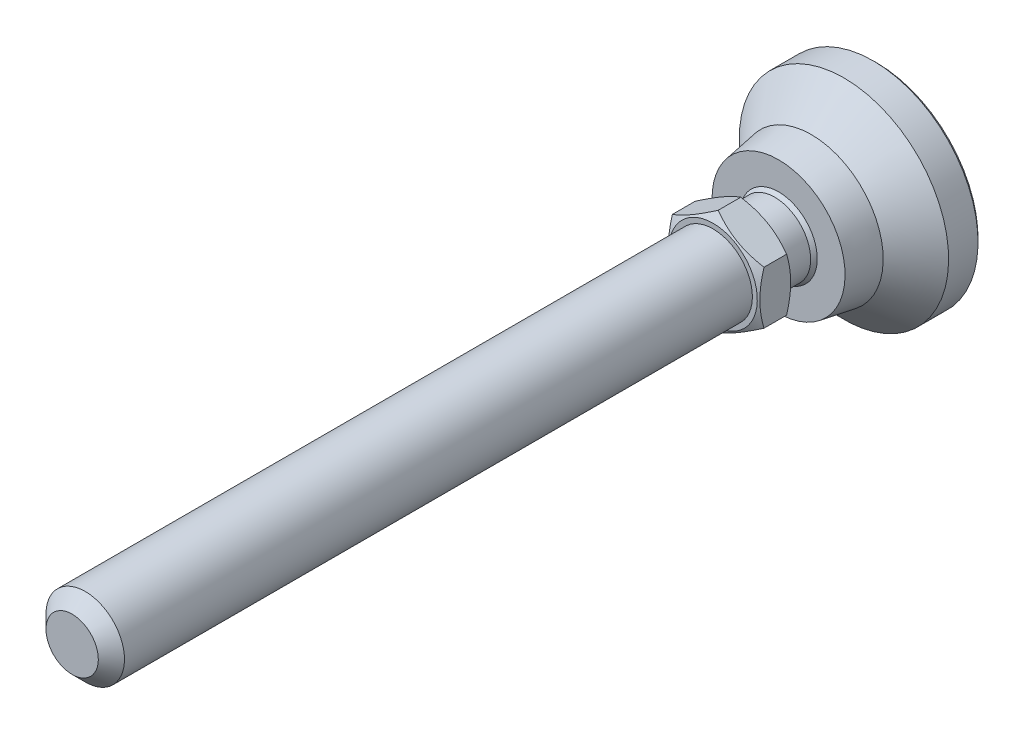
ISO-10303-21;
HEADER;
FILE_DESCRIPTION(('STEP AP214'),'2;1');
FILE_NAME('part.step','',(''),(''),'','','');
FILE_SCHEMA(('AUTOMOTIVE_DESIGN { 1 0 10303 214 1 1 1 1 }'));
ENDSEC;
DATA;
#1=APPLICATION_CONTEXT('core data for automotive mechanical design processes');
#2=APPLICATION_PROTOCOL_DEFINITION('international standard','automotive_design',2000,#1);
#3=PRODUCT_CONTEXT('',#1,'mechanical');
#4=PRODUCT('Part','Part','',(#3));
#5=PRODUCT_RELATED_PRODUCT_CATEGORY('part','',(#4));
#6=PRODUCT_DEFINITION_FORMATION('','',#4);
#7=PRODUCT_DEFINITION_CONTEXT('part definition',#1,'design');
#8=PRODUCT_DEFINITION('design','',#6,#7);
#9=PRODUCT_DEFINITION_SHAPE('','',#8);
#10=(LENGTH_UNIT() NAMED_UNIT(*) SI_UNIT(.MILLI.,.METRE.));
#11=(NAMED_UNIT(*) PLANE_ANGLE_UNIT() SI_UNIT($,.RADIAN.));
#12=(NAMED_UNIT(*) SI_UNIT($,.STERADIAN.) SOLID_ANGLE_UNIT());
#13=UNCERTAINTY_MEASURE_WITH_UNIT(LENGTH_MEASURE(1.E-05),#10,'distance_accuracy_value','');
#14=(GEOMETRIC_REPRESENTATION_CONTEXT(3) GLOBAL_UNCERTAINTY_ASSIGNED_CONTEXT((#13)) GLOBAL_UNIT_ASSIGNED_CONTEXT((#10,
#11,#12)) REPRESENTATION_CONTEXT('',''));
#15=CARTESIAN_POINT('',(0.,0.,0.));
#16=DIRECTION('',(0.,0.,1.));
#17=DIRECTION('',(1.,0.,0.));
#18=AXIS2_PLACEMENT_3D('',#15,#16,#17);
#19=CARTESIAN_POINT('',(0.,-8.08290376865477,19.9999999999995));
#20=DIRECTION('',(0.,0.,-1.));
#21=DIRECTION('',(0.,1.,0.));
#22=AXIS2_PLACEMENT_3D('',#19,#20,#21);
#23=PLANE('',#22);
#24=CARTESIAN_POINT('',(0.,0.,19.9999999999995));
#25=DIRECTION('',(0.,0.,-1.));
#26=DIRECTION('',(0.,1.,0.));
#27=AXIS2_PLACEMENT_3D('',#24,#25,#26);
#28=CIRCLE('',#27,5.50000000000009);
#29=CARTESIAN_POINT('',(0.,5.50000000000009,19.9999999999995));
#30=VERTEX_POINT('',#29);
#31=EDGE_CURVE('E114',#30,#30,#28,.T.);
#32=ORIENTED_EDGE('',*,*,#31,.F.);
#33=EDGE_LOOP('',(#32));
#34=FACE_BOUND('',#33,.T.);
#35=CARTESIAN_POINT('',(0.,0.,19.9999999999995));
#36=DIRECTION('',(0.,0.,-1.));
#37=DIRECTION('',(0.,1.,0.));
#38=AXIS2_PLACEMENT_3D('',#35,#36,#37);
#39=CIRCLE('',#38,6.75);
#40=CARTESIAN_POINT('',(0.,6.75,19.9999999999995));
#41=VERTEX_POINT('',#40);
#42=EDGE_CURVE('E79',#41,#41,#39,.T.);
#43=ORIENTED_EDGE('',*,*,#42,.T.);
#44=EDGE_LOOP('',(#43));
#45=FACE_BOUND('',#44,.T.);
#46=ADVANCED_FACE('F14',(#34,#45),#23,.T.);
#47=CARTESIAN_POINT('',(0.,0.,0.));
#48=DIRECTION('',(0.,0.,-1.));
#49=DIRECTION('',(0.,1.,0.));
#50=AXIS2_PLACEMENT_3D('',#47,#48,#49);
#51=CYLINDRICAL_SURFACE('',#50,5.50000000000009);
#52=ORIENTED_EDGE('',*,*,#31,.T.);
#53=EDGE_LOOP('',(#52));
#54=FACE_BOUND('',#53,.T.);
#55=CARTESIAN_POINT('',(0.,0.,15.5902313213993));
#56=DIRECTION('',(0.,0.,-1.));
#57=DIRECTION('',(0.,1.,0.));
#58=AXIS2_PLACEMENT_3D('',#55,#56,#57);
#59=CIRCLE('',#58,5.50000000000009);
#60=CARTESIAN_POINT('',(-5.50000000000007,0.,15.5902313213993));
#61=VERTEX_POINT('',#60);
#62=EDGE_CURVE('E238',#61,#61,#59,.T.);
#63=ORIENTED_EDGE('',*,*,#62,.F.);
#64=EDGE_LOOP('',(#63));
#65=FACE_BOUND('',#64,.T.);
#66=ADVANCED_FACE('F16',(#54,#65),#51,.T.);
#67=CARTESIAN_POINT('',(0.,0.,11.2601043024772));
#68=DIRECTION('',(0.,0.,-1.));
#69=DIRECTION('',(-1.,0.,0.));
#70=AXIS2_PLACEMENT_3D('',#67,#68,#69);
#71=SPHERICAL_SURFACE('',#70,7.);
#72=CARTESIAN_POINT('',(0.,0.,15.));
#73=DIRECTION('',(0.,0.,-1.));
#74=DIRECTION('',(0.,1.,0.));
#75=AXIS2_PLACEMENT_3D('',#72,#73,#74);
#76=CIRCLE('',#75,5.91719360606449);
#77=CARTESIAN_POINT('',(-5.91719360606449,0.,15.));
#78=VERTEX_POINT('',#77);
#79=EDGE_CURVE('E116',#78,#78,#76,.T.);
#80=CARTESIAN_POINT('',(-5.50000000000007,0.,15.5902313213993));
#81=CARTESIAN_POINT('',(-5.50465946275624,0.,15.5843130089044));
#82=CARTESIAN_POINT('',(-5.50930937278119,0.,15.5783871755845));
#83=CARTESIAN_POINT('',(-5.51859003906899,0.,15.5665205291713));
#84=CARTESIAN_POINT('',(-5.52322079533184,0.,15.5605797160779));
#85=CARTESIAN_POINT('',(-5.53246310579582,0.,15.5486831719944));
#86=CARTESIAN_POINT('',(-5.53707465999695,0.,15.5427274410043));
#87=CARTESIAN_POINT('',(-5.54627851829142,0.,15.5308011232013));
#88=CARTESIAN_POINT('',(-5.55087082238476,0.,15.5248305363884));
#89=CARTESIAN_POINT('',(-5.56003613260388,0.,15.5128745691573));
#90=CARTESIAN_POINT('',(-5.56460913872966,0.,15.5068891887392));
#91=CARTESIAN_POINT('',(-5.57373580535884,0.,15.4949036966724));
#92=CARTESIAN_POINT('',(-5.57828946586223,0.,15.4889035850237));
#93=CARTESIAN_POINT('',(-5.58737739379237,0.,15.4768886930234));
#94=CARTESIAN_POINT('',(-5.59191166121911,0.,15.4708739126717));
#95=CARTESIAN_POINT('',(-5.60096075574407,0.,15.4588297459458));
#96=CARTESIAN_POINT('',(-5.60547558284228,0.,15.4528003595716));
#97=CARTESIAN_POINT('',(-5.6144857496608,0.,15.4407270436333));
#98=CARTESIAN_POINT('',(-5.61898108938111,0.,15.4346831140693));
#99=CARTESIAN_POINT('',(-5.62795223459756,0.,15.4225807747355));
#100=CARTESIAN_POINT('',(-5.6324280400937,0.,15.4165223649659));
#101=CARTESIAN_POINT('',(-5.64136007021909,0.,15.4043911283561));
#102=CARTESIAN_POINT('',(-5.64581629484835,0.,15.398318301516));
#103=CARTESIAN_POINT('',(-5.65470911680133,0.,15.3861582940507));
#104=CARTESIAN_POINT('',(-5.65914571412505,0.,15.3800711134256));
#105=CARTESIAN_POINT('',(-5.66799923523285,0.,15.3678824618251));
#106=CARTESIAN_POINT('',(-5.67241615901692,0.,15.3617809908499));
#107=CARTESIAN_POINT('',(-5.68123028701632,0.,15.3495638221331));
#108=CARTESIAN_POINT('',(-5.68562749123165,0.,15.3434481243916));
#109=CARTESIAN_POINT('',(-5.69440213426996,0.,15.3312025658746));
#110=CARTESIAN_POINT('',(-5.69877957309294,0.,15.3250727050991));
#111=CARTESIAN_POINT('',(-5.70751463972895,0.,15.3127988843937));
#112=CARTESIAN_POINT('',(-5.71187226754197,0.,15.3066549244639));
#113=CARTESIAN_POINT('',(-5.72056766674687,0.,15.2943529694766));
#114=CARTESIAN_POINT('',(-5.72490543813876,0.,15.2881949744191));
#115=CARTESIAN_POINT('',(-5.73356107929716,0.,15.2758650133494));
#116=CARTESIAN_POINT('',(-5.73787894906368,0.,15.2696930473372));
#117=CARTESIAN_POINT('',(-5.74649474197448,0.,15.2573352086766));
#118=CARTESIAN_POINT('',(-5.75079266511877,0.,15.2511493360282));
#119=CARTESIAN_POINT('',(-5.75936851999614,0.,15.2387637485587));
#120=CARTESIAN_POINT('',(-5.76364645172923,0.,15.2325640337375));
#121=CARTESIAN_POINT('',(-5.77218227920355,0.,15.2201508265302));
#122=CARTESIAN_POINT('',(-5.77644017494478,0.,15.2139373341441));
#123=CARTESIAN_POINT('',(-5.78493588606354,0.,15.2014966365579));
#124=CARTESIAN_POINT('',(-5.78917370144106,0.,15.195269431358));
#125=CARTESIAN_POINT('',(-5.79762920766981,0.,15.1828013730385));
#126=CARTESIAN_POINT('',(-5.80184689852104,0.,15.1765605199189));
#127=CARTESIAN_POINT('',(-5.81026211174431,0.,15.1640652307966));
#128=CARTESIAN_POINT('',(-5.81445963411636,0.,15.1578107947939));
#129=CARTESIAN_POINT('',(-5.82283446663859,0.,15.1452884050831));
#130=CARTESIAN_POINT('',(-5.82701177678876,0.,15.1390204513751));
#131=CARTESIAN_POINT('',(-5.83534614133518,0.,15.1264710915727));
#132=CARTESIAN_POINT('',(-5.83950319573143,0.,15.1201896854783));
#133=CARTESIAN_POINT('',(-5.84779700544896,0.,15.107613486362));
#134=CARTESIAN_POINT('',(-5.85193376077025,0.,15.1013186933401));
#135=CARTESIAN_POINT('',(-5.86018692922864,0.,15.0887157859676));
#136=CARTESIAN_POINT('',(-5.86430334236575,0.,15.0824076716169));
#137=CARTESIAN_POINT('',(-5.87251578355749,0.,15.0697781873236));
#138=CARTESIAN_POINT('',(-5.87661181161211,0.,15.063456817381));
#139=CARTESIAN_POINT('',(-5.88478343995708,0.,15.0508008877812));
#140=CARTESIAN_POINT('',(-5.88885904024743,0.,15.044466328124));
#141=CARTESIAN_POINT('',(-5.89698977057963,0.,15.0317840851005));
#142=CARTESIAN_POINT('',(-5.90104490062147,0.,15.0254364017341));
#143=CARTESIAN_POINT('',(-5.909134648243,0.,15.0127279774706));
#144=CARTESIAN_POINT('',(-5.9131692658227,0.,15.0063672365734));
#145=CARTESIAN_POINT('',(-5.91719360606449,0.,15.));
#146=B_SPLINE_CURVE_WITH_KNOTS('',3,(#80,#81,#82,#83,#84,#85,#86,#87,#88,#89,#90,#91,#92,#93,
#94,#95,#96,#97,#98,#99,#100,#101,#102,#103,#104,#105,#106,#107,#108,#109,#110,#111,#112,#113,
#114,#115,#116,#117,#118,#119,#120,#121,#122,#123,#124,#125,#126,#127,#128,#129,#130,#131,#132,
#133,#134,#135,#136,#137,#138,#139,#140,#141,#142,#143,#144,#145),.UNSPECIFIED.,.F.,.F.,(4,2,2,
2,2,2,2,2,2,2,2,2,2,2,2,2,2,2,2,2,2,2,2,2,2,2,2,2,2,2,2,2,4),(0.,0.0225971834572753,
0.0451943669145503,0.0677915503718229,0.0903887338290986,0.112985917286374,0.135583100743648,
0.158180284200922,0.180777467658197,0.203374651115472,0.225971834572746,0.248569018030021,
0.271166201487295,0.293763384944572,0.316360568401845,0.338957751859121,0.361554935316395,
0.384152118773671,0.406749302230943,0.429346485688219,0.451943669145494,0.474540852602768,
0.497138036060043,0.519735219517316,0.542332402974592,0.564929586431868,0.587526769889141,
0.610123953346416,0.632721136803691,0.655318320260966,0.67791550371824,0.700512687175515,
0.72310987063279),.UNSPECIFIED.);
#147=EDGE_CURVE('BSEAM251',#61,#78,#146,.T.);
#148=ORIENTED_EDGE('',*,*,#62,.T.);
#149=ORIENTED_EDGE('',*,*,#79,.F.);
#150=ORIENTED_EDGE('',*,*,#147,.T.);
#151=ORIENTED_EDGE('',*,*,#147,.F.);
#152=EDGE_LOOP('',(#148,#150,#149,#151));
#153=FACE_BOUND('',#152,.T.);
#154=ADVANCED_FACE('F251',(#153),#71,.T.);
#155=CARTESIAN_POINT('',(-15.5,0.,0.));
#156=DIRECTION('',(0.,0.,1.));
#157=DIRECTION('',(0.,-1.,0.));
#158=AXIS2_PLACEMENT_3D('',#155,#156,#157);
#159=PLANE('',#158);
#160=CARTESIAN_POINT('',(0.,0.,0.));
#161=DIRECTION('',(0.,0.,-1.));
#162=DIRECTION('',(0.,1.,0.));
#163=AXIS2_PLACEMENT_3D('',#160,#161,#162);
#164=CIRCLE('',#163,15.5);
#165=CARTESIAN_POINT('',(0.,15.5,0.));
#166=VERTEX_POINT('',#165);
#167=EDGE_CURVE('E88',#166,#166,#164,.T.);
#168=ORIENTED_EDGE('',*,*,#167,.T.);
#169=EDGE_LOOP('',(#168));
#170=FACE_BOUND('',#169,.T.);
#171=ADVANCED_FACE('F253',(#170),#159,.F.);
#172=CARTESIAN_POINT('',(0.,0.,0.500000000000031));
#173=DIRECTION('',(0.,0.,1.));
#174=DIRECTION('',(0.,-1.,0.));
#175=AXIS2_PLACEMENT_3D('',#172,#173,#174);
#176=CONICAL_SURFACE('',#175,16.,0.785398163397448);
#177=ORIENTED_EDGE('',*,*,#167,.F.);
#178=EDGE_LOOP('',(#177));
#179=FACE_BOUND('',#178,.T.);
#180=CARTESIAN_POINT('',(0.,0.,0.500000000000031));
#181=DIRECTION('',(0.,0.,-1.));
#182=DIRECTION('',(0.,1.,0.));
#183=AXIS2_PLACEMENT_3D('',#180,#181,#182);
#184=CIRCLE('',#183,16.);
#185=CARTESIAN_POINT('',(0.,16.,0.500000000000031));
#186=VERTEX_POINT('',#185);
#187=EDGE_CURVE('E91',#186,#186,#184,.T.);
#188=ORIENTED_EDGE('',*,*,#187,.T.);
#189=EDGE_LOOP('',(#188));
#190=FACE_BOUND('',#189,.T.);
#191=ADVANCED_FACE('F260',(#179,#190),#176,.T.);
#192=CARTESIAN_POINT('',(0.,0.,0.));
#193=DIRECTION('',(0.,0.,-1.));
#194=DIRECTION('',(0.,1.,0.));
#195=AXIS2_PLACEMENT_3D('',#192,#193,#194);
#196=CYLINDRICAL_SURFACE('',#195,16.);
#197=ORIENTED_EDGE('',*,*,#187,.F.);
#198=EDGE_LOOP('',(#197));
#199=FACE_BOUND('',#198,.T.);
#200=CARTESIAN_POINT('',(0.,0.,5.00000000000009));
#201=DIRECTION('',(0.,0.,-1.));
#202=DIRECTION('',(0.,1.,0.));
#203=AXIS2_PLACEMENT_3D('',#200,#201,#202);
#204=CIRCLE('',#203,16.);
#205=CARTESIAN_POINT('',(0.,16.,5.00000000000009));
#206=VERTEX_POINT('',#205);
#207=EDGE_CURVE('E108',#206,#206,#204,.T.);
#208=ORIENTED_EDGE('',*,*,#207,.T.);
#209=EDGE_LOOP('',(#208));
#210=FACE_BOUND('',#209,.T.);
#211=ADVANCED_FACE('F361',(#199,#210),#196,.T.);
#212=CARTESIAN_POINT('',(0.,0.,10.));
#213=DIRECTION('',(0.,0.,-1.));
#214=DIRECTION('',(0.,1.,0.));
#215=AXIS2_PLACEMENT_3D('',#212,#213,#214);
#216=CONICAL_SURFACE('',#215,11.,0.785398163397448);
#217=ORIENTED_EDGE('',*,*,#207,.F.);
#218=EDGE_LOOP('',(#217));
#219=FACE_BOUND('',#218,.T.);
#220=CARTESIAN_POINT('',(0.,0.,10.));
#221=DIRECTION('',(0.,0.,-1.));
#222=DIRECTION('',(0.,1.,0.));
#223=AXIS2_PLACEMENT_3D('',#220,#221,#222);
#224=CIRCLE('',#223,11.);
#225=CARTESIAN_POINT('',(0.,11.,10.));
#226=VERTEX_POINT('',#225);
#227=EDGE_CURVE('E111',#226,#226,#224,.T.);
#228=ORIENTED_EDGE('',*,*,#227,.T.);
#229=EDGE_LOOP('',(#228));
#230=FACE_BOUND('',#229,.T.);
#231=ADVANCED_FACE('F351',(#219,#230),#216,.T.);
#232=CARTESIAN_POINT('',(0.,0.,16.));
#233=DIRECTION('',(0.,0.,-1.));
#234=DIRECTION('',(0.,1.,0.));
#235=AXIS2_PLACEMENT_3D('',#232,#233,#234);
#236=CONICAL_SURFACE('',#235,10.,0.165148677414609);
#237=ORIENTED_EDGE('',*,*,#227,.F.);
#238=EDGE_LOOP('',(#237));
#239=FACE_BOUND('',#238,.T.);
#240=CARTESIAN_POINT('',(0.,0.,15.));
#241=DIRECTION('',(0.,0.,-1.));
#242=DIRECTION('',(0.,1.,0.));
#243=AXIS2_PLACEMENT_3D('',#240,#241,#242);
#244=CIRCLE('',#243,10.1666666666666);
#245=CARTESIAN_POINT('',(0.,10.1666666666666,15.));
#246=VERTEX_POINT('',#245);
#247=EDGE_CURVE('E96',#246,#246,#244,.T.);
#248=ORIENTED_EDGE('',*,*,#247,.T.);
#249=EDGE_LOOP('',(#248));
#250=FACE_BOUND('',#249,.T.);
#251=ADVANCED_FACE('F245',(#239,#250),#236,.T.);
#252=CARTESIAN_POINT('',(-6.60079601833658,0.,15.));
#253=DIRECTION('',(0.,0.,1.));
#254=DIRECTION('',(0.,-1.,0.));
#255=AXIS2_PLACEMENT_3D('',#252,#253,#254);
#256=PLANE('',#255);
#257=ORIENTED_EDGE('',*,*,#247,.F.);
#258=EDGE_LOOP('',(#257));
#259=FACE_BOUND('',#258,.T.);
#260=ORIENTED_EDGE('',*,*,#79,.T.);
#261=EDGE_LOOP('',(#260));
#262=FACE_BOUND('',#261,.T.);
#263=ADVANCED_FACE('F164',(#259,#262),#256,.T.);
#264=CARTESIAN_POINT('',(0.,0.,19.9999999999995));
#265=DIRECTION('',(0.,0.,1.));
#266=DIRECTION('',(0.,-1.,0.));
#267=AXIS2_PLACEMENT_3D('',#264,#265,#266);
#268=CONICAL_SURFACE('',#267,6.75,1.0471975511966);
#269=CARTESIAN_POINT('',(-7.0002,-4.04133641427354,20.7696190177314));
#270=CARTESIAN_POINT('',(-6.84633209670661,-4.13017208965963,20.7183374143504));
#271=CARTESIAN_POINT('',(-6.69189049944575,-4.21933898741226,20.6693831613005));
#272=CARTESIAN_POINT('',(-6.38175307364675,-4.39839691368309,20.576770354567));
#273=CARTESIAN_POINT('',(-6.22605673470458,-4.48828823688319,20.5331140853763));
#274=CARTESIAN_POINT('',(-5.75647483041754,-4.7594014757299,20.4109491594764));
#275=CARTESIAN_POINT('',(-5.4407356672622,-4.94169356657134,20.3414631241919));
#276=CARTESIAN_POINT('',(-4.96823775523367,-5.21449036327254,20.259982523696));
#277=CARTESIAN_POINT('',(-4.81289077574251,-5.30417998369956,20.2367710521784));
#278=CARTESIAN_POINT('',(-4.50149488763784,-5.48396448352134,20.1978487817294));
#279=CARTESIAN_POINT('',(-4.34544604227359,-5.57405932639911,20.1821373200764));
#280=CARTESIAN_POINT('',(-4.03307732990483,-5.75440548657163,20.15861548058));
#281=CARTESIAN_POINT('',(-3.87675797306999,-5.84465650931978,20.1507961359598));
#282=CARTESIAN_POINT('',(-3.56398349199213,-6.02523694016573,20.1432178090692));
#283=CARTESIAN_POINT('',(-3.40752837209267,-6.11556634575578,20.1434585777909));
#284=CARTESIAN_POINT('',(-2.97889312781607,-6.36303901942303,20.1551972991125));
#285=CARTESIAN_POINT('',(-2.7068533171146,-6.52010127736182,20.1749033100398));
#286=CARTESIAN_POINT('',(-2.1645805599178,-6.83318259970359,20.2373910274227));
#287=CARTESIAN_POINT('',(-1.89434952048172,-6.9892005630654,20.2801940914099));
#288=CARTESIAN_POINT('',(-1.35098545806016,-7.30291195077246,20.3871892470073));
#289=CARTESIAN_POINT('',(-1.07792099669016,-7.46056579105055,20.4518346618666));
#290=CARTESIAN_POINT('',(-0.535864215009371,-7.77352241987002,20.5985536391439));
#291=CARTESIAN_POINT('',(-0.266864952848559,-7.92882921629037,20.6805927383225));
#292=CARTESIAN_POINT('',(0.00020000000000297,-8.0830192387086,20.7696190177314));
#293=B_SPLINE_CURVE_WITH_KNOTS('',3,(#269,#270,#271,#272,#273,#274,#275,#276,#277,#278,#279,
#280,#281,#282,#283,#284,#285,#286,#287,#288,#289,#290,#291,#292),.UNSPECIFIED.,.F.,.F.,(4,2,2,
2,2,2,2,2,2,2,2,4),(0.,0.554727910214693,1.10969417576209,2.2219327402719,2.76443041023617,
3.30688013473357,3.8487128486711,4.39052882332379,5.33376515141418,6.27787517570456,
7.2429241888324,8.20607866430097),.UNSPECIFIED.);
#294=CARTESIAN_POINT('',(-7.,-4.04145188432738,20.7695523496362));
#295=VERTEX_POINT('',#294);
#296=CARTESIAN_POINT('',(0.,-8.08290376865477,20.7695523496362));
#297=VERTEX_POINT('',#296);
#298=EDGE_CURVE('E72',#295,#297,#293,.T.);
#299=ORIENTED_EDGE('',*,*,#298,.F.);
#300=CARTESIAN_POINT('',(-7.,10.8288805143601,23.547450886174));
#301=CARTESIAN_POINT('',(-7.,10.5233685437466,23.3993587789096));
#302=CARTESIAN_POINT('',(-7.,10.217152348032,23.2526944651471));
#303=CARTESIAN_POINT('',(-7.,9.60293688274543,22.9630249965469));
#304=CARTESIAN_POINT('',(-7.,9.29493733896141,22.8200204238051));
#305=CARTESIAN_POINT('',(-7.,8.67518069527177,22.5377487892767));
#306=CARTESIAN_POINT('',(-7.,8.36341224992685,22.3985065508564));
#307=CARTESIAN_POINT('',(-7.,7.737386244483,22.1257564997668));
#308=CARTESIAN_POINT('',(-7.,7.42312880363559,21.9922484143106));
#309=CARTESIAN_POINT('',(-7.,6.78158751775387,21.7283527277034));
#310=CARTESIAN_POINT('',(-7.,6.45420696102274,21.5981989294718));
#311=CARTESIAN_POINT('',(-7.,5.79560657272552,21.3478072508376));
#312=CARTESIAN_POINT('',(-7.,5.46438631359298,21.2275704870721));
#313=CARTESIAN_POINT('',(-7.,4.7982042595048,21.0001894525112));
#314=CARTESIAN_POINT('',(-7.,4.46325169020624,20.8930184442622));
#315=CARTESIAN_POINT('',(-7.,3.78855412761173,20.6952241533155));
#316=CARTESIAN_POINT('',(-7.,3.44881068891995,20.6045956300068));
#317=CARTESIAN_POINT('',(-7.,2.76616135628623,20.4447397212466));
#318=CARTESIAN_POINT('',(-7.,2.4232831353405,20.3753973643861));
#319=CARTESIAN_POINT('',(-7.,1.90586512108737,20.2903641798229));
#320=CARTESIAN_POINT('',(-7.,1.73286276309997,20.2651820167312));
#321=CARTESIAN_POINT('',(-7.,1.3860073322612,20.2216390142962));
#322=CARTESIAN_POINT('',(-7.,1.21215434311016,20.203277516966));
#323=CARTESIAN_POINT('',(-7.,0.866089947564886,20.1739705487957));
#324=CARTESIAN_POINT('',(-7.,0.693886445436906,20.1629321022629));
#325=CARTESIAN_POINT('',(-7.,0.349167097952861,20.1481453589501));
#326=CARTESIAN_POINT('',(-7.,0.176651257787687,20.144396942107));
#327=CARTESIAN_POINT('',(-7.,-0.168384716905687,20.1442796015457));
#328=CARTESIAN_POINT('',(-7.,-0.340904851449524,20.1479107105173));
#329=CARTESIAN_POINT('',(-7.,-0.685639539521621,20.162464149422));
#330=CARTESIAN_POINT('',(-7.,-0.857854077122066,20.1733868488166));
#331=CARTESIAN_POINT('',(-7.,-1.27255725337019,20.2082386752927));
#332=CARTESIAN_POINT('',(-7.,-1.51475744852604,20.2356728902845));
#333=CARTESIAN_POINT('',(-7.,-1.99733109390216,20.3034604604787));
#334=CARTESIAN_POINT('',(-7.,-2.23770428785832,20.3438155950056));
#335=CARTESIAN_POINT('',(-7.,-2.95582484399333,20.4821200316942));
#336=CARTESIAN_POINT('',(-7.,-3.43029934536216,20.5972823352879));
#337=CARTESIAN_POINT('',(-7.,-4.13973168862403,20.7966194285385));
#338=CARTESIAN_POINT('',(-7.,-4.37837845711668,20.8684174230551));
#339=CARTESIAN_POINT('',(-7.,-4.85335344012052,21.0193797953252));
#340=CARTESIAN_POINT('',(-7.,-5.08968163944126,21.0985442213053));
#341=CARTESIAN_POINT('',(-7.,-5.56009559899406,21.2629768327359));
#342=CARTESIAN_POINT('',(-7.,-5.79418208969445,21.3482429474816));
#343=CARTESIAN_POINT('',(-7.,-6.26042169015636,21.5238847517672));
#344=CARTESIAN_POINT('',(-7.,-6.49257482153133,21.6142603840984));
#345=CARTESIAN_POINT('',(-7.,-7.03625682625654,21.8317041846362));
#346=CARTESIAN_POINT('',(-7.,-7.34708185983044,21.9605288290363));
#347=CARTESIAN_POINT('',(-7.,-7.9661258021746,22.224312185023));
#348=CARTESIAN_POINT('',(-7.,-8.27434455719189,22.3592712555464));
#349=CARTESIAN_POINT('',(-7.,-8.8886498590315,22.6341031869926));
#350=CARTESIAN_POINT('',(-7.,-9.19473597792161,22.7739770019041));
#351=CARTESIAN_POINT('',(-7.,-9.80508021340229,23.0576645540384));
#352=CARTESIAN_POINT('',(-7.,-10.109338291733,23.2014783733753));
#353=CARTESIAN_POINT('',(-7.,-10.7166330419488,23.4924615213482));
#354=CARTESIAN_POINT('',(-7.,-11.0196681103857,23.6396341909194));
#355=CARTESIAN_POINT('',(-7.,-11.6244404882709,23.9366246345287));
#356=CARTESIAN_POINT('',(-7.,-11.9261777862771,24.0864424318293));
#357=CARTESIAN_POINT('',(-7.,-12.8296727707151,24.5391271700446));
#358=CARTESIAN_POINT('',(-7.,-13.4297922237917,24.8452634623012));
#359=CARTESIAN_POINT('',(-7.,-14.5773247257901,25.4381003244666));
#360=CARTESIAN_POINT('',(-7.,-15.1249907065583,25.7243134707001));
#361=CARTESIAN_POINT('',(-7.,-16.2182846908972,26.3006481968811));
#362=CARTESIAN_POINT('',(-7.,-16.7639126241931,26.5907699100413));
#363=CARTESIAN_POINT('',(-7.,-17.8522485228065,27.1732837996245));
#364=CARTESIAN_POINT('',(-7.,-18.39496036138,27.4656687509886));
#365=CARTESIAN_POINT('',(-7.,-19.4790786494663,28.0527803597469));
#366=CARTESIAN_POINT('',(-7.,-20.0204851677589,28.3475068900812));
#367=CARTESIAN_POINT('',(-7.,-20.5614100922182,28.6431087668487));
#368=B_SPLINE_CURVE_WITH_KNOTS('',3,(#300,#301,#302,#303,#304,#305,#306,#307,#308,#309,#310,
#311,#312,#313,#314,#315,#316,#317,#318,#319,#320,#321,#322,#323,#324,#325,#326,#327,#328,#329,
#330,#331,#332,#333,#334,#335,#336,#337,#338,#339,#340,#341,#342,#343,#344,#345,#346,#347,#348,
#349,#350,#351,#352,#353,#354,#355,#356,#357,#358,#359,#360,#361,#362,#363,#364,#365,#366,#367),
.UNSPECIFIED.,.F.,.F.,(4,2,2,2,2,2,2,2,2,2,2,2,2,2,2,2,2,2,2,2,2,2,2,2,2,2,2,2,2,2,2,2,2,4),(0.,
1.01855050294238,2.03726201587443,3.06156515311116,4.0858195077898,5.14260656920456,
6.19951246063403,7.25421786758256,8.30858856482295,9.35715987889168,9.88152308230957,
10.4058356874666,10.9233571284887,11.440870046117,11.9583852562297,12.4759266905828,
13.2067601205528,13.9376942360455,15.400383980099,16.1479624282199,16.8955457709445,
17.6428766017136,18.3901990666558,19.3995025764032,20.4088652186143,21.4184248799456,
22.4280055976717,23.438638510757,24.4492803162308,26.4703018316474,28.32411991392,
30.1780013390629,32.0273805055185,33.8766599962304),.UNSPECIFIED.);
#369=CARTESIAN_POINT('',(-7.,4.04145188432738,20.7695523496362));
#370=VERTEX_POINT('',#369);
#371=EDGE_CURVE('E75',#370,#295,#368,.T.);
#372=ORIENTED_EDGE('',*,*,#371,.F.);
#373=CARTESIAN_POINT('',(0.000199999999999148,8.0830192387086,20.7696190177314));
#374=CARTESIAN_POINT('',(-0.153667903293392,7.99418356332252,20.7183374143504));
#375=CARTESIAN_POINT('',(-0.30810950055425,7.90501666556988,20.6693831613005));
#376=CARTESIAN_POINT('',(-0.618246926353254,7.72595873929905,20.576770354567));
#377=CARTESIAN_POINT('',(-0.773943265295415,7.63606741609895,20.5331140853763));
#378=CARTESIAN_POINT('',(-1.24352516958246,7.36495417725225,20.4109491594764));
#379=CARTESIAN_POINT('',(-1.5592643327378,7.18266208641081,20.3414631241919));
#380=CARTESIAN_POINT('',(-2.03176224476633,6.9098652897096,20.259982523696));
#381=CARTESIAN_POINT('',(-2.18710922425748,6.82017566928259,20.2367710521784));
#382=CARTESIAN_POINT('',(-2.49850511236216,6.64039116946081,20.1978487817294));
#383=CARTESIAN_POINT('',(-2.65455395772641,6.55029632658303,20.1821373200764));
#384=CARTESIAN_POINT('',(-2.96692267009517,6.36995016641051,20.15861548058));
#385=CARTESIAN_POINT('',(-3.12324202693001,6.27969914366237,20.1507961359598));
#386=CARTESIAN_POINT('',(-3.43601650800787,6.09911871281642,20.1432178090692));
#387=CARTESIAN_POINT('',(-3.59247162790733,6.00878930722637,20.1434585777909));
#388=CARTESIAN_POINT('',(-4.02110687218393,5.76131663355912,20.1551972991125));
#389=CARTESIAN_POINT('',(-4.2931466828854,5.60425437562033,20.1749033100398));
#390=CARTESIAN_POINT('',(-4.83541944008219,5.29117305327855,20.2373910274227));
#391=CARTESIAN_POINT('',(-5.10565047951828,5.13515508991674,20.2801940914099));
#392=CARTESIAN_POINT('',(-5.64901454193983,4.82144370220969,20.3871892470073));
#393=CARTESIAN_POINT('',(-5.92207900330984,4.66378986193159,20.4518346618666));
#394=CARTESIAN_POINT('',(-6.46413578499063,4.35083323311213,20.5985536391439));
#395=CARTESIAN_POINT('',(-6.73313504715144,4.19552643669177,20.6805927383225));
#396=CARTESIAN_POINT('',(-7.0002,4.04133641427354,20.7696190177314));
#397=B_SPLINE_CURVE_WITH_KNOTS('',3,(#373,#374,#375,#376,#377,#378,#379,#380,#381,#382,#383,
#384,#385,#386,#387,#388,#389,#390,#391,#392,#393,#394,#395,#396),.UNSPECIFIED.,.F.,.F.,(4,2,2,
2,2,2,2,2,2,2,2,4),(0.,0.554727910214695,1.10969417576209,2.2219327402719,2.76443041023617,
3.30688013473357,3.84871284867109,4.39052882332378,5.33376515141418,6.27787517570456,
7.2429241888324,8.20607866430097),.UNSPECIFIED.);
#398=CARTESIAN_POINT('',(0.,8.08290376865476,20.7695523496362));
#399=VERTEX_POINT('',#398);
#400=EDGE_CURVE('E84',#399,#370,#397,.T.);
#401=ORIENTED_EDGE('',*,*,#400,.F.);
#402=CARTESIAN_POINT('',(7.0002,4.04133641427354,20.7696190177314));
#403=CARTESIAN_POINT('',(6.84633209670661,4.13017208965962,20.7183374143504));
#404=CARTESIAN_POINT('',(6.69189049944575,4.21933898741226,20.6693831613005));
#405=CARTESIAN_POINT('',(6.38175307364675,4.39839691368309,20.576770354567));
#406=CARTESIAN_POINT('',(6.22605673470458,4.48828823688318,20.5331140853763));
#407=CARTESIAN_POINT('',(5.75647483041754,4.75940147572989,20.4109491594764));
#408=CARTESIAN_POINT('',(5.4407356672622,4.94169356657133,20.3414631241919));
#409=CARTESIAN_POINT('',(4.96823775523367,5.21449036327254,20.259982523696));
#410=CARTESIAN_POINT('',(4.81289077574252,5.30417998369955,20.2367710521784));
#411=CARTESIAN_POINT('',(4.50149488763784,5.48396448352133,20.1978487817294));
#412=CARTESIAN_POINT('',(4.34544604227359,5.57405932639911,20.1821373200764));
#413=CARTESIAN_POINT('',(4.03307732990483,5.75440548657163,20.15861548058));
#414=CARTESIAN_POINT('',(3.87675797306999,5.84465650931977,20.1507961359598));
#415=CARTESIAN_POINT('',(3.56398349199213,6.02523694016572,20.1432178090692));
#416=CARTESIAN_POINT('',(3.40752837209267,6.11556634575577,20.1434585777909));
#417=CARTESIAN_POINT('',(2.97889312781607,6.36303901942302,20.1551972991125));
#418=CARTESIAN_POINT('',(2.7068533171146,6.52010127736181,20.1749033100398));
#419=CARTESIAN_POINT('',(2.16458055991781,6.83318259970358,20.2373910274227));
#420=CARTESIAN_POINT('',(1.89434952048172,6.9892005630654,20.2801940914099));
#421=CARTESIAN_POINT('',(1.35098545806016,7.30291195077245,20.3871892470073));
#422=CARTESIAN_POINT('',(1.07792099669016,7.46056579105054,20.4518346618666));
#423=CARTESIAN_POINT('',(0.53586421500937,7.77352241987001,20.5985536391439));
#424=CARTESIAN_POINT('',(0.266864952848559,7.92882921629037,20.6805927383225));
#425=CARTESIAN_POINT('',(-0.0002000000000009,8.0830192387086,20.7696190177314));
#426=B_SPLINE_CURVE_WITH_KNOTS('',3,(#402,#403,#404,#405,#406,#407,#408,#409,#410,#411,#412,
#413,#414,#415,#416,#417,#418,#419,#420,#421,#422,#423,#424,#425),.UNSPECIFIED.,.F.,.F.,(4,2,2,
2,2,2,2,2,2,2,2,4),(0.,0.554727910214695,1.10969417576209,2.2219327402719,2.76443041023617,
3.30688013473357,3.8487128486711,4.39052882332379,5.33376515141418,6.27787517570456,
7.2429241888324,8.20607866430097),.UNSPECIFIED.);
#427=CARTESIAN_POINT('',(7.,4.04145188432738,20.7695523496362));
#428=VERTEX_POINT('',#427);
#429=EDGE_CURVE('E192',#428,#399,#426,.T.);
#430=ORIENTED_EDGE('',*,*,#429,.F.);
#431=CARTESIAN_POINT('',(7.,10.8288805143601,23.547450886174));
#432=CARTESIAN_POINT('',(7.,10.5233685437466,23.3993587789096));
#433=CARTESIAN_POINT('',(7.,10.217152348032,23.2526944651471));
#434=CARTESIAN_POINT('',(7.,9.60293688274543,22.9630249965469));
#435=CARTESIAN_POINT('',(7.,9.29493733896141,22.8200204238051));
#436=CARTESIAN_POINT('',(7.,8.67518069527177,22.5377487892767));
#437=CARTESIAN_POINT('',(7.,8.36341224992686,22.3985065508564));
#438=CARTESIAN_POINT('',(7.,7.737386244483,22.1257564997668));
#439=CARTESIAN_POINT('',(7.,7.42312880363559,21.9922484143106));
#440=CARTESIAN_POINT('',(7.,6.78158751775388,21.7283527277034));
#441=CARTESIAN_POINT('',(7.,6.45420696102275,21.5981989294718));
#442=CARTESIAN_POINT('',(7.,5.79560657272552,21.3478072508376));
#443=CARTESIAN_POINT('',(7.,5.46438631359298,21.2275704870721));
#444=CARTESIAN_POINT('',(7.,4.7982042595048,21.0001894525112));
#445=CARTESIAN_POINT('',(7.,4.46325169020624,20.8930184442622));
#446=CARTESIAN_POINT('',(7.,3.78855412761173,20.6952241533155));
#447=CARTESIAN_POINT('',(7.,3.44881068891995,20.6045956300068));
#448=CARTESIAN_POINT('',(7.,2.76616135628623,20.4447397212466));
#449=CARTESIAN_POINT('',(7.,2.4232831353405,20.3753973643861));
#450=CARTESIAN_POINT('',(7.,1.90586512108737,20.2903641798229));
#451=CARTESIAN_POINT('',(7.,1.73286276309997,20.2651820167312));
#452=CARTESIAN_POINT('',(7.,1.3860073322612,20.2216390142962));
#453=CARTESIAN_POINT('',(7.,1.21215434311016,20.203277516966));
#454=CARTESIAN_POINT('',(7.,0.866089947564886,20.1739705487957));
#455=CARTESIAN_POINT('',(7.,0.693886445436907,20.1629321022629));
#456=CARTESIAN_POINT('',(7.,0.349167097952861,20.1481453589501));
#457=CARTESIAN_POINT('',(7.,0.176651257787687,20.144396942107));
#458=CARTESIAN_POINT('',(7.,-0.168384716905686,20.1442796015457));
#459=CARTESIAN_POINT('',(7.,-0.340904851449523,20.1479107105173));
#460=CARTESIAN_POINT('',(7.,-0.685639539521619,20.162464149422));
#461=CARTESIAN_POINT('',(7.,-0.857854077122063,20.1733868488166));
#462=CARTESIAN_POINT('',(7.,-1.27255725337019,20.2082386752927));
#463=CARTESIAN_POINT('',(7.,-1.51475744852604,20.2356728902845));
#464=CARTESIAN_POINT('',(7.,-1.99733109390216,20.3034604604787));
#465=CARTESIAN_POINT('',(7.,-2.23770428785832,20.3438155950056));
#466=CARTESIAN_POINT('',(7.,-2.95582484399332,20.4821200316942));
#467=CARTESIAN_POINT('',(7.,-3.43029934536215,20.5972823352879));
#468=CARTESIAN_POINT('',(7.,-4.13973168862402,20.7966194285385));
#469=CARTESIAN_POINT('',(7.,-4.37837845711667,20.8684174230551));
#470=CARTESIAN_POINT('',(7.,-4.85335344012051,21.0193797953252));
#471=CARTESIAN_POINT('',(7.,-5.08968163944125,21.0985442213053));
#472=CARTESIAN_POINT('',(7.,-5.56009559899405,21.2629768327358));
#473=CARTESIAN_POINT('',(7.,-5.79418208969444,21.3482429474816));
#474=CARTESIAN_POINT('',(7.,-6.26042169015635,21.5238847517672));
#475=CARTESIAN_POINT('',(7.,-6.49257482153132,21.6142603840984));
#476=CARTESIAN_POINT('',(7.,-7.03625682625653,21.8317041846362));
#477=CARTESIAN_POINT('',(7.,-7.34708185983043,21.9605288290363));
#478=CARTESIAN_POINT('',(7.,-7.96612580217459,22.224312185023));
#479=CARTESIAN_POINT('',(7.,-8.27434455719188,22.3592712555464));
#480=CARTESIAN_POINT('',(7.,-8.8886498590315,22.6341031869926));
#481=CARTESIAN_POINT('',(7.,-9.1947359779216,22.7739770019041));
#482=CARTESIAN_POINT('',(7.,-9.80508021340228,23.0576645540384));
#483=CARTESIAN_POINT('',(7.,-10.109338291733,23.2014783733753));
#484=CARTESIAN_POINT('',(7.,-10.7166330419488,23.4924615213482));
#485=CARTESIAN_POINT('',(7.,-11.0196681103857,23.6396341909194));
#486=CARTESIAN_POINT('',(7.,-11.6244404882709,23.9366246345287));
#487=CARTESIAN_POINT('',(7.,-11.9261777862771,24.0864424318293));
#488=CARTESIAN_POINT('',(7.,-12.8296727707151,24.5391271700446));
#489=CARTESIAN_POINT('',(7.,-13.4297922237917,24.8452634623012));
#490=CARTESIAN_POINT('',(7.,-14.5773247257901,25.4381003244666));
#491=CARTESIAN_POINT('',(7.,-15.1249907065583,25.7243134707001));
#492=CARTESIAN_POINT('',(7.,-16.2182846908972,26.3006481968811));
#493=CARTESIAN_POINT('',(7.,-16.7639126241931,26.5907699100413));
#494=CARTESIAN_POINT('',(7.,-17.8522485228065,27.1732837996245));
#495=CARTESIAN_POINT('',(7.,-18.39496036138,27.4656687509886));
#496=CARTESIAN_POINT('',(7.,-19.4790786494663,28.0527803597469));
#497=CARTESIAN_POINT('',(7.,-20.0204851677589,28.3475068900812));
#498=CARTESIAN_POINT('',(7.,-20.5614100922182,28.6431087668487));
#499=B_SPLINE_CURVE_WITH_KNOTS('',3,(#431,#432,#433,#434,#435,#436,#437,#438,#439,#440,#441,
#442,#443,#444,#445,#446,#447,#448,#449,#450,#451,#452,#453,#454,#455,#456,#457,#458,#459,#460,
#461,#462,#463,#464,#465,#466,#467,#468,#469,#470,#471,#472,#473,#474,#475,#476,#477,#478,#479,
#480,#481,#482,#483,#484,#485,#486,#487,#488,#489,#490,#491,#492,#493,#494,#495,#496,#497,#498),
.UNSPECIFIED.,.F.,.F.,(4,2,2,2,2,2,2,2,2,2,2,2,2,2,2,2,2,2,2,2,2,2,2,2,2,2,2,2,2,2,2,2,2,4),(0.,
1.01855050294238,2.03726201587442,3.06156515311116,4.0858195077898,5.14260656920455,
6.19951246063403,7.25421786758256,8.30858856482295,9.35715987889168,9.88152308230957,
10.4058356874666,10.9233571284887,11.440870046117,11.9583852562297,12.4759266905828,
13.2067601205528,13.9376942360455,15.400383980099,16.1479624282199,16.8955457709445,
17.6428766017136,18.3901990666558,19.3995025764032,20.4088652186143,21.4184248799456,
22.4280055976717,23.438638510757,24.4492803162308,26.4703018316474,28.32411991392,
30.1780013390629,32.0273805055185,33.8766599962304),.UNSPECIFIED.);
#500=CARTESIAN_POINT('',(7.,-4.04145188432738,20.7695523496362));
#501=VERTEX_POINT('',#500);
#502=EDGE_CURVE('E137',#501,#428,#499,.F.);
#503=ORIENTED_EDGE('',*,*,#502,.F.);
#504=CARTESIAN_POINT('',(-0.00019999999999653,-8.08301923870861,20.7696190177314));
#505=CARTESIAN_POINT('',(0.153667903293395,-7.99418356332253,20.7183374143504));
#506=CARTESIAN_POINT('',(0.308109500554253,-7.90501666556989,20.6693831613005));
#507=CARTESIAN_POINT('',(0.618246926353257,-7.72595873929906,20.576770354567));
#508=CARTESIAN_POINT('',(0.773943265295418,-7.63606741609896,20.5331140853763));
#509=CARTESIAN_POINT('',(1.24352516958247,-7.36495417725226,20.4109491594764));
#510=CARTESIAN_POINT('',(1.5592643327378,-7.18266208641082,20.3414631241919));
#511=CARTESIAN_POINT('',(2.03176224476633,-6.90986528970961,20.259982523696));
#512=CARTESIAN_POINT('',(2.18710922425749,-6.8201756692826,20.2367710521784));
#513=CARTESIAN_POINT('',(2.49850511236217,-6.64039116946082,20.1978487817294));
#514=CARTESIAN_POINT('',(2.65455395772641,-6.55029632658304,20.1821373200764));
#515=CARTESIAN_POINT('',(2.96692267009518,-6.36995016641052,20.15861548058));
#516=CARTESIAN_POINT('',(3.12324202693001,-6.27969914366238,20.1507961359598));
#517=CARTESIAN_POINT('',(3.43601650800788,-6.09911871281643,20.1432178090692));
#518=CARTESIAN_POINT('',(3.59247162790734,-6.00878930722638,20.1434585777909));
#519=CARTESIAN_POINT('',(4.02110687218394,-5.76131663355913,20.1551972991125));
#520=CARTESIAN_POINT('',(4.2931466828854,-5.60425437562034,20.1749033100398));
#521=CARTESIAN_POINT('',(4.8354194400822,-5.29117305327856,20.2373910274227));
#522=CARTESIAN_POINT('',(5.10565047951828,-5.13515508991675,20.2801940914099));
#523=CARTESIAN_POINT('',(5.64901454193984,-4.8214437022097,20.3871892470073));
#524=CARTESIAN_POINT('',(5.92207900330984,-4.6637898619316,20.4518346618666));
#525=CARTESIAN_POINT('',(6.46413578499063,-4.35083323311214,20.5985536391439));
#526=CARTESIAN_POINT('',(6.73313504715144,-4.19552643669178,20.6805927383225));
#527=CARTESIAN_POINT('',(7.0002,-4.04133641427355,20.7696190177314));
#528=B_SPLINE_CURVE_WITH_KNOTS('',3,(#504,#505,#506,#507,#508,#509,#510,#511,#512,#513,#514,
#515,#516,#517,#518,#519,#520,#521,#522,#523,#524,#525,#526,#527),.UNSPECIFIED.,.F.,.F.,(4,2,2,
2,2,2,2,2,2,2,2,4),(0.,0.554727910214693,1.10969417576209,2.2219327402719,2.76443041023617,
3.30688013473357,3.84871284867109,4.39052882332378,5.33376515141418,6.27787517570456,
7.24292418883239,8.20607866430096),.UNSPECIFIED.);
#529=EDGE_CURVE('E35',#297,#501,#528,.T.);
#530=ORIENTED_EDGE('',*,*,#529,.F.);
#531=EDGE_LOOP('',(#299,#372,#401,#430,#503,#530));
#532=FACE_BOUND('',#531,.T.);
#533=ORIENTED_EDGE('',*,*,#42,.F.);
#534=EDGE_LOOP('',(#533));
#535=FACE_BOUND('',#534,.T.);
#536=ADVANCED_FACE('F73',(#532,#535),#268,.T.);
#537=CARTESIAN_POINT('',(0.,0.,123.));
#538=DIRECTION('',(0.,0.,-1.));
#539=DIRECTION('',(0.,1.,0.));
#540=AXIS2_PLACEMENT_3D('',#537,#538,#539);
#541=PLANE('',#540);
#542=CARTESIAN_POINT('',(0.,0.,123.));
#543=DIRECTION('',(0.,0.,-1.));
#544=DIRECTION('',(0.,1.,0.));
#545=AXIS2_PLACEMENT_3D('',#542,#543,#544);
#546=CIRCLE('',#545,4.);
#547=CARTESIAN_POINT('',(0.,4.,123.));
#548=VERTEX_POINT('',#547);
#549=EDGE_CURVE('E117',#548,#548,#546,.T.);
#550=ORIENTED_EDGE('',*,*,#549,.F.);
#551=EDGE_LOOP('',(#550));
#552=FACE_BOUND('',#551,.T.);
#553=ADVANCED_FACE('F186',(#552),#541,.F.);
#554=CARTESIAN_POINT('',(0.,0.,123.));
#555=DIRECTION('',(0.,0.,-1.));
#556=DIRECTION('',(0.,1.,0.));
#557=AXIS2_PLACEMENT_3D('',#554,#555,#556);
#558=CONICAL_SURFACE('',#557,4.,0.785398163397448);
#559=CARTESIAN_POINT('',(0.,0.,121.));
#560=DIRECTION('',(0.,0.,-1.));
#561=DIRECTION('',(0.,1.,0.));
#562=AXIS2_PLACEMENT_3D('',#559,#560,#561);
#563=CIRCLE('',#562,6.);
#564=CARTESIAN_POINT('',(0.,6.,121.));
#565=VERTEX_POINT('',#564);
#566=EDGE_CURVE('E232',#565,#565,#563,.T.);
#567=ORIENTED_EDGE('',*,*,#566,.F.);
#568=EDGE_LOOP('',(#567));
#569=FACE_BOUND('',#568,.T.);
#570=ORIENTED_EDGE('',*,*,#549,.T.);
#571=EDGE_LOOP('',(#570));
#572=FACE_BOUND('',#571,.T.);
#573=ADVANCED_FACE('F275',(#569,#572),#558,.T.);
#574=CARTESIAN_POINT('',(0.,0.,0.));
#575=DIRECTION('',(0.,0.,-1.));
#576=DIRECTION('',(0.,1.,0.));
#577=AXIS2_PLACEMENT_3D('',#574,#575,#576);
#578=CYLINDRICAL_SURFACE('',#577,6.);
#579=CARTESIAN_POINT('',(0.,0.,24.9999999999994));
#580=DIRECTION('',(0.,0.,-1.));
#581=DIRECTION('',(0.,1.,0.));
#582=AXIS2_PLACEMENT_3D('',#579,#580,#581);
#583=CIRCLE('',#582,6.);
#584=CARTESIAN_POINT('',(0.,6.,24.9999999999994));
#585=VERTEX_POINT('',#584);
#586=EDGE_CURVE('E28',#585,#585,#583,.F.);
#587=ORIENTED_EDGE('',*,*,#586,.T.);
#588=EDGE_LOOP('',(#587));
#589=FACE_BOUND('',#588,.T.);
#590=ORIENTED_EDGE('',*,*,#566,.T.);
#591=EDGE_LOOP('',(#590));
#592=FACE_BOUND('',#591,.T.);
#593=ADVANCED_FACE('F121',(#589,#592),#578,.T.);
#594=CARTESIAN_POINT('',(-7.,12.1243556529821,24.9999999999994));
#595=DIRECTION('',(0.,0.,-1.));
#596=DIRECTION('',(0.,1.,0.));
#597=AXIS2_PLACEMENT_3D('',#594,#595,#596);
#598=PLANE('',#597);
#599=ORIENTED_EDGE('',*,*,#586,.F.);
#600=EDGE_LOOP('',(#599));
#601=FACE_BOUND('',#600,.T.);
#602=CARTESIAN_POINT('',(0.,0.,24.9999999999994));
#603=DIRECTION('',(0.,0.,-1.));
#604=DIRECTION('',(0.,1.,0.));
#605=AXIS2_PLACEMENT_3D('',#602,#603,#604);
#606=CIRCLE('',#605,6.75);
#607=CARTESIAN_POINT('',(0.,6.75,24.9999999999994));
#608=VERTEX_POINT('',#607);
#609=EDGE_CURVE('E131',#608,#608,#606,.T.);
#610=ORIENTED_EDGE('',*,*,#609,.F.);
#611=EDGE_LOOP('',(#610));
#612=FACE_BOUND('',#611,.T.);
#613=ADVANCED_FACE('F124',(#601,#612),#598,.F.);
#614=CARTESIAN_POINT('',(0.,0.,23.2933078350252));
#615=DIRECTION('',(0.,0.,-1.));
#616=DIRECTION('',(0.,1.,0.));
#617=AXIS2_PLACEMENT_3D('',#614,#615,#616);
#618=CONICAL_SURFACE('',#617,9.7060775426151,1.0471975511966);
#619=CARTESIAN_POINT('',(7.,10.8288805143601,21.452549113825));
#620=CARTESIAN_POINT('',(7.,10.5233685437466,21.6006412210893));
#621=CARTESIAN_POINT('',(7.,10.217152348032,21.7473055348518));
#622=CARTESIAN_POINT('',(7.,9.60293688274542,22.036975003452));
#623=CARTESIAN_POINT('',(7.,9.29493733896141,22.1799795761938));
#624=CARTESIAN_POINT('',(7.,8.67518069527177,22.4622512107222));
#625=CARTESIAN_POINT('',(7.,8.36341224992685,22.6014934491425));
#626=CARTESIAN_POINT('',(7.,7.737386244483,22.8742435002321));
#627=CARTESIAN_POINT('',(7.,7.42312880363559,23.0077515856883));
#628=CARTESIAN_POINT('',(7.,6.78158751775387,23.2716472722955));
#629=CARTESIAN_POINT('',(7.,6.45420696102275,23.4018010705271));
#630=CARTESIAN_POINT('',(7.,5.79560657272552,23.6521927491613));
#631=CARTESIAN_POINT('',(7.,5.46438631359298,23.7724295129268));
#632=CARTESIAN_POINT('',(7.,4.79820425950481,23.9998105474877));
#633=CARTESIAN_POINT('',(7.,4.46325169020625,24.1069815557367));
#634=CARTESIAN_POINT('',(7.,3.78855412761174,24.3047758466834));
#635=CARTESIAN_POINT('',(7.,3.44881068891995,24.3954043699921));
#636=CARTESIAN_POINT('',(7.,2.76616135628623,24.5552602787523));
#637=CARTESIAN_POINT('',(7.,2.4232831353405,24.6246026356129));
#638=CARTESIAN_POINT('',(7.,1.90586512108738,24.709635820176));
#639=CARTESIAN_POINT('',(7.,1.73286276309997,24.7348179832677));
#640=CARTESIAN_POINT('',(7.,1.3860073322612,24.7783609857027));
#641=CARTESIAN_POINT('',(7.,1.21215434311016,24.796722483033));
#642=CARTESIAN_POINT('',(7.,0.866089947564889,24.8260294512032));
#643=CARTESIAN_POINT('',(7.,0.69388644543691,24.837067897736));
#644=CARTESIAN_POINT('',(7.,0.349167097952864,24.8518546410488));
#645=CARTESIAN_POINT('',(7.,0.17665125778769,24.8556030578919));
#646=CARTESIAN_POINT('',(7.,-0.168384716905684,24.8557203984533));
#647=CARTESIAN_POINT('',(7.,-0.340904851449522,24.8520892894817));
#648=CARTESIAN_POINT('',(7.,-0.685639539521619,24.8375358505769));
#649=CARTESIAN_POINT('',(7.,-0.857854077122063,24.8266131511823));
#650=CARTESIAN_POINT('',(7.,-1.27255725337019,24.7917613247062));
#651=CARTESIAN_POINT('',(7.,-1.51475744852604,24.7643271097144));
#652=CARTESIAN_POINT('',(7.,-1.99733109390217,24.6965395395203));
#653=CARTESIAN_POINT('',(7.,-2.23770428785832,24.6561844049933));
#654=CARTESIAN_POINT('',(7.,-2.95582484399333,24.5178799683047));
#655=CARTESIAN_POINT('',(7.,-3.43029934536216,24.402717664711));
#656=CARTESIAN_POINT('',(7.,-4.13973168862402,24.2033805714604));
#657=CARTESIAN_POINT('',(7.,-4.37837845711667,24.1315825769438));
#658=CARTESIAN_POINT('',(7.,-4.85335344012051,23.9806202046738));
#659=CARTESIAN_POINT('',(7.,-5.08968163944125,23.9014557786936));
#660=CARTESIAN_POINT('',(7.,-5.56009559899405,23.7370231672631));
#661=CARTESIAN_POINT('',(7.,-5.79418208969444,23.6517570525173));
#662=CARTESIAN_POINT('',(7.,-6.26042169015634,23.4761152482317));
#663=CARTESIAN_POINT('',(7.,-6.49257482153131,23.3857396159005));
#664=CARTESIAN_POINT('',(7.,-7.03625682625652,23.1682958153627));
#665=CARTESIAN_POINT('',(7.,-7.34708185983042,23.0394711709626));
#666=CARTESIAN_POINT('',(7.,-7.96612580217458,22.7756878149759));
#667=CARTESIAN_POINT('',(7.,-8.27434455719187,22.6407287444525));
#668=CARTESIAN_POINT('',(7.,-8.88864985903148,22.3658968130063));
#669=CARTESIAN_POINT('',(7.,-9.19473597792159,22.2260229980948));
#670=CARTESIAN_POINT('',(7.,-9.80508021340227,21.9423354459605));
#671=CARTESIAN_POINT('',(7.,-10.109338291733,21.7985216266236));
#672=CARTESIAN_POINT('',(7.,-10.7166330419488,21.5075384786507));
#673=CARTESIAN_POINT('',(7.,-11.0196681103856,21.3603658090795));
#674=CARTESIAN_POINT('',(7.,-11.6244404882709,21.0633753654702));
#675=CARTESIAN_POINT('',(7.,-11.9261777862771,20.9135575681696));
#676=CARTESIAN_POINT('',(7.,-12.829672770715,20.4608728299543));
#677=CARTESIAN_POINT('',(7.,-13.4297922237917,20.1547365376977));
#678=CARTESIAN_POINT('',(7.,-14.5773247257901,19.5618996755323));
#679=CARTESIAN_POINT('',(7.,-15.1249907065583,19.2756865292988));
#680=CARTESIAN_POINT('',(7.,-16.2182846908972,18.6993518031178));
#681=CARTESIAN_POINT('',(7.,-16.763912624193,18.4092300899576));
#682=CARTESIAN_POINT('',(7.,-17.8522485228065,17.8267162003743));
#683=CARTESIAN_POINT('',(7.,-18.39496036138,17.5343312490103));
#684=CARTESIAN_POINT('',(7.,-19.4790786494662,16.947219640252));
#685=CARTESIAN_POINT('',(7.,-20.0204851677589,16.6524931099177));
#686=CARTESIAN_POINT('',(7.,-20.5614100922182,16.3568912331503));
#687=B_SPLINE_CURVE_WITH_KNOTS('',3,(#619,#620,#621,#622,#623,#624,#625,#626,#627,#628,#629,
#630,#631,#632,#633,#634,#635,#636,#637,#638,#639,#640,#641,#642,#643,#644,#645,#646,#647,#648,
#649,#650,#651,#652,#653,#654,#655,#656,#657,#658,#659,#660,#661,#662,#663,#664,#665,#666,#667,
#668,#669,#670,#671,#672,#673,#674,#675,#676,#677,#678,#679,#680,#681,#682,#683,#684,#685,#686),
.UNSPECIFIED.,.F.,.F.,(4,2,2,2,2,2,2,2,2,2,2,2,2,2,2,2,2,2,2,2,2,2,2,2,2,2,2,2,2,2,2,2,2,4),(0.,
1.01855050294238,2.03726201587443,3.06156515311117,4.0858195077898,5.14260656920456,
6.19951246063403,7.25421786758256,8.30858856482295,9.35715987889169,9.88152308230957,
10.4058356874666,10.9233571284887,11.440870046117,11.9583852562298,12.4759266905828,
13.2067601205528,13.9376942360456,15.400383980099,16.1479624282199,16.8955457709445,
17.6428766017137,18.3901990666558,19.3995025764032,20.4088652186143,21.4184248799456,
22.4280055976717,23.438638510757,24.4492803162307,26.4703018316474,28.32411991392,
30.1780013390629,32.0273805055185,33.8766599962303),.UNSPECIFIED.);
#688=CARTESIAN_POINT('',(7.,4.04145188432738,24.2304476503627));
#689=VERTEX_POINT('',#688);
#690=CARTESIAN_POINT('',(7.,-4.04145188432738,24.2304476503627));
#691=VERTEX_POINT('',#690);
#692=EDGE_CURVE('E213',#689,#691,#687,.T.);
#693=ORIENTED_EDGE('',*,*,#692,.F.);
#694=CARTESIAN_POINT('',(-0.000200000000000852,8.0830192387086,24.2303809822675));
#695=CARTESIAN_POINT('',(0.153667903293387,7.99418356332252,24.2816625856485));
#696=CARTESIAN_POINT('',(0.308109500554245,7.90501666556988,24.3306168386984));
#697=CARTESIAN_POINT('',(0.618246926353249,7.72595873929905,24.4232296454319));
#698=CARTESIAN_POINT('',(0.773943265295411,7.63606741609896,24.4668859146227));
#699=CARTESIAN_POINT('',(1.24352516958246,7.36495417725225,24.5890508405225));
#700=CARTESIAN_POINT('',(1.55926433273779,7.18266208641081,24.6585368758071));
#701=CARTESIAN_POINT('',(2.03176224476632,6.90986528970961,24.7400174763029));
#702=CARTESIAN_POINT('',(2.18710922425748,6.82017566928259,24.7632289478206));
#703=CARTESIAN_POINT('',(2.49850511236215,6.64039116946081,24.8021512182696));
#704=CARTESIAN_POINT('',(2.6545539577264,6.55029632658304,24.8178626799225));
#705=CARTESIAN_POINT('',(2.96692267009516,6.36995016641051,24.841384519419));
#706=CARTESIAN_POINT('',(3.12324202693,6.27969914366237,24.8492038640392));
#707=CARTESIAN_POINT('',(3.43601650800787,6.09911871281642,24.8567821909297));
#708=CARTESIAN_POINT('',(3.59247162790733,6.00878930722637,24.856541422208));
#709=CARTESIAN_POINT('',(4.02110687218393,5.76131663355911,24.8448027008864));
#710=CARTESIAN_POINT('',(4.2931466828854,5.60425437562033,24.8250966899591));
#711=CARTESIAN_POINT('',(4.8354194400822,5.29117305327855,24.7626089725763));
#712=CARTESIAN_POINT('',(5.10565047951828,5.13515508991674,24.719805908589));
#713=CARTESIAN_POINT('',(5.64901454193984,4.82144370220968,24.6128107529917));
#714=CARTESIAN_POINT('',(5.92207900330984,4.66378986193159,24.5481653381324));
#715=CARTESIAN_POINT('',(6.46413578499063,4.35083323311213,24.401446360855));
#716=CARTESIAN_POINT('',(6.73313504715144,4.19552643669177,24.3194072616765));
#717=CARTESIAN_POINT('',(7.0002,4.04133641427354,24.2303809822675));
#718=B_SPLINE_CURVE_WITH_KNOTS('',3,(#694,#695,#696,#697,#698,#699,#700,#701,#702,#703,#704,
#705,#706,#707,#708,#709,#710,#711,#712,#713,#714,#715,#716,#717),.UNSPECIFIED.,.F.,.F.,(4,2,2,
2,2,2,2,2,2,2,2,4),(0.,0.554727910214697,1.1096941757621,2.2219327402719,2.76443041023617,
3.30688013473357,3.8487128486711,4.39052882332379,5.33376515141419,6.27787517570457,
7.24292418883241,8.20607866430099),.UNSPECIFIED.);
#719=CARTESIAN_POINT('',(0.,8.08290376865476,24.2304476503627));
#720=VERTEX_POINT('',#719);
#721=EDGE_CURVE('E221',#720,#689,#718,.T.);
#722=ORIENTED_EDGE('',*,*,#721,.F.);
#723=CARTESIAN_POINT('',(-7.0002,4.04133641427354,24.2303809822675));
#724=CARTESIAN_POINT('',(-6.84633209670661,4.13017208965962,24.2816625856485));
#725=CARTESIAN_POINT('',(-6.69189049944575,4.21933898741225,24.3306168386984));
#726=CARTESIAN_POINT('',(-6.38175307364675,4.39839691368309,24.4232296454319));
#727=CARTESIAN_POINT('',(-6.22605673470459,4.48828823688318,24.4668859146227));
#728=CARTESIAN_POINT('',(-5.75647483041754,4.75940147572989,24.5890508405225));
#729=CARTESIAN_POINT('',(-5.44073566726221,4.94169356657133,24.6585368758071));
#730=CARTESIAN_POINT('',(-4.96823775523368,5.21449036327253,24.7400174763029));
#731=CARTESIAN_POINT('',(-4.81289077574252,5.30417998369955,24.7632289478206));
#732=CARTESIAN_POINT('',(-4.50149488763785,5.48396448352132,24.8021512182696));
#733=CARTESIAN_POINT('',(-4.3454460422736,5.5740593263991,24.8178626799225));
#734=CARTESIAN_POINT('',(-4.03307732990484,5.75440548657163,24.841384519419));
#735=CARTESIAN_POINT('',(-3.87675797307,5.84465650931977,24.8492038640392));
#736=CARTESIAN_POINT('',(-3.56398349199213,6.02523694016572,24.8567821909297));
#737=CARTESIAN_POINT('',(-3.40752837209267,6.11556634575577,24.856541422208));
#738=CARTESIAN_POINT('',(-2.97889312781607,6.36303901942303,24.8448027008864));
#739=CARTESIAN_POINT('',(-2.7068533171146,6.52010127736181,24.8250966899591));
#740=CARTESIAN_POINT('',(-2.1645805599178,6.83318259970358,24.7626089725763));
#741=CARTESIAN_POINT('',(-1.89434952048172,6.9892005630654,24.719805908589));
#742=CARTESIAN_POINT('',(-1.35098545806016,7.30291195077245,24.6128107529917));
#743=CARTESIAN_POINT('',(-1.07792099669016,7.46056579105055,24.5481653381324));
#744=CARTESIAN_POINT('',(-0.535864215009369,7.77352241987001,24.401446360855));
#745=CARTESIAN_POINT('',(-0.266864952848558,7.92882921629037,24.3194072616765));
#746=CARTESIAN_POINT('',(0.000199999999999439,8.0830192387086,24.2303809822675));
#747=B_SPLINE_CURVE_WITH_KNOTS('',3,(#723,#724,#725,#726,#727,#728,#729,#730,#731,#732,#733,
#734,#735,#736,#737,#738,#739,#740,#741,#742,#743,#744,#745,#746),.UNSPECIFIED.,.F.,.F.,(4,2,2,
2,2,2,2,2,2,2,2,4),(0.,0.554727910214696,1.10969417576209,2.2219327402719,2.76443041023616,
3.30688013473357,3.8487128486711,4.39052882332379,5.33376515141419,6.27787517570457,
7.24292418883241,8.20607866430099),.UNSPECIFIED.);
#748=CARTESIAN_POINT('',(-7.,4.04145188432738,24.2304476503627));
#749=VERTEX_POINT('',#748);
#750=EDGE_CURVE('E135',#749,#720,#747,.T.);
#751=ORIENTED_EDGE('',*,*,#750,.F.);
#752=CARTESIAN_POINT('',(-7.,10.8288805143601,21.452549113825));
#753=CARTESIAN_POINT('',(-7.,10.5233685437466,21.6006412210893));
#754=CARTESIAN_POINT('',(-7.,10.217152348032,21.7473055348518));
#755=CARTESIAN_POINT('',(-7.,9.60293688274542,22.036975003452));
#756=CARTESIAN_POINT('',(-7.,9.29493733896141,22.1799795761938));
#757=CARTESIAN_POINT('',(-7.,8.67518069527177,22.4622512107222));
#758=CARTESIAN_POINT('',(-7.,8.36341224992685,22.6014934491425));
#759=CARTESIAN_POINT('',(-7.,7.737386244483,22.8742435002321));
#760=CARTESIAN_POINT('',(-7.,7.42312880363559,23.0077515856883));
#761=CARTESIAN_POINT('',(-7.,6.78158751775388,23.2716472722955));
#762=CARTESIAN_POINT('',(-7.,6.45420696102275,23.4018010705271));
#763=CARTESIAN_POINT('',(-7.,5.79560657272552,23.6521927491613));
#764=CARTESIAN_POINT('',(-7.,5.46438631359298,23.7724295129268));
#765=CARTESIAN_POINT('',(-7.,4.79820425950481,23.9998105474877));
#766=CARTESIAN_POINT('',(-7.,4.46325169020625,24.1069815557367));
#767=CARTESIAN_POINT('',(-7.,3.78855412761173,24.3047758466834));
#768=CARTESIAN_POINT('',(-7.,3.44881068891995,24.3954043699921));
#769=CARTESIAN_POINT('',(-7.,2.76616135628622,24.5552602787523));
#770=CARTESIAN_POINT('',(-7.,2.4232831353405,24.6246026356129));
#771=CARTESIAN_POINT('',(-7.,1.90586512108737,24.709635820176));
#772=CARTESIAN_POINT('',(-7.,1.73286276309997,24.7348179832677));
#773=CARTESIAN_POINT('',(-7.,1.3860073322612,24.7783609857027));
#774=CARTESIAN_POINT('',(-7.,1.21215434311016,24.796722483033));
#775=CARTESIAN_POINT('',(-7.,0.866089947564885,24.8260294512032));
#776=CARTESIAN_POINT('',(-7.,0.693886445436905,24.837067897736));
#777=CARTESIAN_POINT('',(-7.,0.34916709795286,24.8518546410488));
#778=CARTESIAN_POINT('',(-7.,0.176651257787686,24.8556030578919));
#779=CARTESIAN_POINT('',(-7.,-0.168384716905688,24.8557203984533));
#780=CARTESIAN_POINT('',(-7.,-0.340904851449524,24.8520892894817));
#781=CARTESIAN_POINT('',(-7.,-0.685639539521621,24.8375358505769));
#782=CARTESIAN_POINT('',(-7.,-0.857854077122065,24.8266131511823));
#783=CARTESIAN_POINT('',(-7.,-1.27255725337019,24.7917613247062));
#784=CARTESIAN_POINT('',(-7.,-1.51475744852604,24.7643271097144));
#785=CARTESIAN_POINT('',(-7.,-1.99733109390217,24.6965395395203));
#786=CARTESIAN_POINT('',(-7.,-2.23770428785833,24.6561844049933));
#787=CARTESIAN_POINT('',(-7.,-2.95582484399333,24.5178799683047));
#788=CARTESIAN_POINT('',(-7.,-3.43029934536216,24.402717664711));
#789=CARTESIAN_POINT('',(-7.,-4.13973168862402,24.2033805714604));
#790=CARTESIAN_POINT('',(-7.,-4.37837845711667,24.1315825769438));
#791=CARTESIAN_POINT('',(-7.,-4.85335344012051,23.9806202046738));
#792=CARTESIAN_POINT('',(-7.,-5.08968163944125,23.9014557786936));
#793=CARTESIAN_POINT('',(-7.,-5.56009559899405,23.7370231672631));
#794=CARTESIAN_POINT('',(-7.,-5.79418208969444,23.6517570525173));
#795=CARTESIAN_POINT('',(-7.,-6.26042169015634,23.4761152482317));
#796=CARTESIAN_POINT('',(-7.,-6.49257482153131,23.3857396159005));
#797=CARTESIAN_POINT('',(-7.,-7.03625682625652,23.1682958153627));
#798=CARTESIAN_POINT('',(-7.,-7.34708185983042,23.0394711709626));
#799=CARTESIAN_POINT('',(-7.,-7.96612580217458,22.7756878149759));
#800=CARTESIAN_POINT('',(-7.,-8.27434455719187,22.6407287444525));
#801=CARTESIAN_POINT('',(-7.,-8.88864985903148,22.3658968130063));
#802=CARTESIAN_POINT('',(-7.,-9.19473597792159,22.2260229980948));
#803=CARTESIAN_POINT('',(-7.,-9.80508021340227,21.9423354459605));
#804=CARTESIAN_POINT('',(-7.,-10.109338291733,21.7985216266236));
#805=CARTESIAN_POINT('',(-7.,-10.7166330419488,21.5075384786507));
#806=CARTESIAN_POINT('',(-7.,-11.0196681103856,21.3603658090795));
#807=CARTESIAN_POINT('',(-7.,-11.6244404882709,21.0633753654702));
#808=CARTESIAN_POINT('',(-7.,-11.9261777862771,20.9135575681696));
#809=CARTESIAN_POINT('',(-7.,-12.829672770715,20.4608728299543));
#810=CARTESIAN_POINT('',(-7.,-13.4297922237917,20.1547365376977));
#811=CARTESIAN_POINT('',(-7.,-14.5773247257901,19.5618996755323));
#812=CARTESIAN_POINT('',(-7.,-15.1249907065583,19.2756865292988));
#813=CARTESIAN_POINT('',(-7.,-16.2182846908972,18.6993518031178));
#814=CARTESIAN_POINT('',(-7.,-16.763912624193,18.4092300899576));
#815=CARTESIAN_POINT('',(-7.,-17.8522485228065,17.8267162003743));
#816=CARTESIAN_POINT('',(-7.,-18.39496036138,17.5343312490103));
#817=CARTESIAN_POINT('',(-7.,-19.4790786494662,16.947219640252));
#818=CARTESIAN_POINT('',(-7.,-20.0204851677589,16.6524931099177));
#819=CARTESIAN_POINT('',(-7.,-20.5614100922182,16.3568912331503));
#820=B_SPLINE_CURVE_WITH_KNOTS('',3,(#752,#753,#754,#755,#756,#757,#758,#759,#760,#761,#762,
#763,#764,#765,#766,#767,#768,#769,#770,#771,#772,#773,#774,#775,#776,#777,#778,#779,#780,#781,
#782,#783,#784,#785,#786,#787,#788,#789,#790,#791,#792,#793,#794,#795,#796,#797,#798,#799,#800,
#801,#802,#803,#804,#805,#806,#807,#808,#809,#810,#811,#812,#813,#814,#815,#816,#817,#818,#819),
.UNSPECIFIED.,.F.,.F.,(4,2,2,2,2,2,2,2,2,2,2,2,2,2,2,2,2,2,2,2,2,2,2,2,2,2,2,2,2,2,2,2,2,4),(0.,
1.01855050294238,2.03726201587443,3.06156515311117,4.0858195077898,5.14260656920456,
6.19951246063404,7.25421786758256,8.30858856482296,9.35715987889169,9.88152308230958,
10.4058356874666,10.9233571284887,11.440870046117,11.9583852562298,12.4759266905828,
13.2067601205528,13.9376942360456,15.400383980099,16.1479624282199,16.8955457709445,
17.6428766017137,18.3901990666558,19.3995025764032,20.4088652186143,21.4184248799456,
22.4280055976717,23.438638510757,24.4492803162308,26.4703018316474,28.32411991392,
30.1780013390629,32.0273805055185,33.8766599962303),.UNSPECIFIED.);
#821=CARTESIAN_POINT('',(-7.,-4.04145188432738,24.2304476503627));
#822=VERTEX_POINT('',#821);
#823=EDGE_CURVE('E133',#822,#749,#820,.F.);
#824=ORIENTED_EDGE('',*,*,#823,.F.);
#825=CARTESIAN_POINT('',(0.000200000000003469,-8.0830192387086,24.2303809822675));
#826=CARTESIAN_POINT('',(-0.153667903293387,-7.99418356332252,24.2816625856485));
#827=CARTESIAN_POINT('',(-0.308109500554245,-7.90501666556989,24.3306168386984));
#828=CARTESIAN_POINT('',(-0.61824692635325,-7.72595873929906,24.4232296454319));
#829=CARTESIAN_POINT('',(-0.773943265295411,-7.63606741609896,24.4668859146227));
#830=CARTESIAN_POINT('',(-1.24352516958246,-7.36495417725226,24.5890508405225));
#831=CARTESIAN_POINT('',(-1.5592643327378,-7.18266208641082,24.6585368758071));
#832=CARTESIAN_POINT('',(-2.03176224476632,-6.90986528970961,24.7400174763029));
#833=CARTESIAN_POINT('',(-2.18710922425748,-6.8201756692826,24.7632289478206));
#834=CARTESIAN_POINT('',(-2.49850511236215,-6.64039116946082,24.8021512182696));
#835=CARTESIAN_POINT('',(-2.6545539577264,-6.55029632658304,24.8178626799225));
#836=CARTESIAN_POINT('',(-2.96692267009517,-6.36995016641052,24.841384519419));
#837=CARTESIAN_POINT('',(-3.12324202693,-6.27969914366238,24.8492038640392));
#838=CARTESIAN_POINT('',(-3.43601650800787,-6.09911871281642,24.8567821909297));
#839=CARTESIAN_POINT('',(-3.59247162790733,-6.00878930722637,24.856541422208));
#840=CARTESIAN_POINT('',(-4.02110687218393,-5.76131663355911,24.8448027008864));
#841=CARTESIAN_POINT('',(-4.2931466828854,-5.60425437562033,24.8250966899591));
#842=CARTESIAN_POINT('',(-4.8354194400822,-5.29117305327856,24.7626089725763));
#843=CARTESIAN_POINT('',(-5.10565047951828,-5.13515508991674,24.719805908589));
#844=CARTESIAN_POINT('',(-5.64901454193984,-4.82144370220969,24.6128107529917));
#845=CARTESIAN_POINT('',(-5.92207900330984,-4.6637898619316,24.5481653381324));
#846=CARTESIAN_POINT('',(-6.46413578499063,-4.35083323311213,24.401446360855));
#847=CARTESIAN_POINT('',(-6.73313504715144,-4.19552643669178,24.3194072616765));
#848=CARTESIAN_POINT('',(-7.0002,-4.04133641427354,24.2303809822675));
#849=B_SPLINE_CURVE_WITH_KNOTS('',3,(#825,#826,#827,#828,#829,#830,#831,#832,#833,#834,#835,
#836,#837,#838,#839,#840,#841,#842,#843,#844,#845,#846,#847,#848),.UNSPECIFIED.,.F.,.F.,(4,2,2,
2,2,2,2,2,2,2,2,4),(0.,0.554727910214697,1.10969417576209,2.2219327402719,2.76443041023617,
3.30688013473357,3.8487128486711,4.39052882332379,5.33376515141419,6.27787517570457,
7.24292418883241,8.20607866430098),.UNSPECIFIED.);
#850=CARTESIAN_POINT('',(0.,-8.08290376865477,24.2304476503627));
#851=VERTEX_POINT('',#850);
#852=EDGE_CURVE('E9',#851,#822,#849,.T.);
#853=ORIENTED_EDGE('',*,*,#852,.F.);
#854=CARTESIAN_POINT('',(7.0002,-4.04133641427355,24.2303809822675));
#855=CARTESIAN_POINT('',(6.84633209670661,-4.13017208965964,24.2816625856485));
#856=CARTESIAN_POINT('',(6.69189049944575,-4.21933898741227,24.3306168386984));
#857=CARTESIAN_POINT('',(6.38175307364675,-4.3983969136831,24.4232296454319));
#858=CARTESIAN_POINT('',(6.22605673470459,-4.4882882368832,24.4668859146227));
#859=CARTESIAN_POINT('',(5.75647483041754,-4.7594014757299,24.5890508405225));
#860=CARTESIAN_POINT('',(5.4407356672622,-4.94169356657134,24.6585368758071));
#861=CARTESIAN_POINT('',(4.96823775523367,-5.21449036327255,24.7400174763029));
#862=CARTESIAN_POINT('',(4.81289077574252,-5.30417998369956,24.7632289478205));
#863=CARTESIAN_POINT('',(4.50149488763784,-5.48396448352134,24.8021512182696));
#864=CARTESIAN_POINT('',(4.34544604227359,-5.57405932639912,24.8178626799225));
#865=CARTESIAN_POINT('',(4.03307732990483,-5.75440548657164,24.841384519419));
#866=CARTESIAN_POINT('',(3.87675797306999,-5.84465650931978,24.8492038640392));
#867=CARTESIAN_POINT('',(3.56398349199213,-6.02523694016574,24.8567821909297));
#868=CARTESIAN_POINT('',(3.40752837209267,-6.11556634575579,24.856541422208));
#869=CARTESIAN_POINT('',(2.97889312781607,-6.36303901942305,24.8448027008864));
#870=CARTESIAN_POINT('',(2.7068533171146,-6.52010127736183,24.8250966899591));
#871=CARTESIAN_POINT('',(2.1645805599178,-6.8331825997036,24.7626089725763));
#872=CARTESIAN_POINT('',(1.89434952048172,-6.98920056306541,24.719805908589));
#873=CARTESIAN_POINT('',(1.35098545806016,-7.30291195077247,24.6128107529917));
#874=CARTESIAN_POINT('',(1.07792099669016,-7.46056579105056,24.5481653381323));
#875=CARTESIAN_POINT('',(0.53586421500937,-7.77352241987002,24.401446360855));
#876=CARTESIAN_POINT('',(0.26686495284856,-7.92882921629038,24.3194072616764));
#877=CARTESIAN_POINT('',(-0.00019999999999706,-8.08301923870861,24.2303809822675));
#878=B_SPLINE_CURVE_WITH_KNOTS('',3,(#854,#855,#856,#857,#858,#859,#860,#861,#862,#863,#864,
#865,#866,#867,#868,#869,#870,#871,#872,#873,#874,#875,#876,#877),.UNSPECIFIED.,.F.,.F.,(4,2,2,
2,2,2,2,2,2,2,2,4),(0.,0.554727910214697,1.10969417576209,2.2219327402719,2.76443041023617,
3.30688013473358,3.8487128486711,4.39052882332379,5.33376515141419,6.27787517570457,
7.2429241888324,8.20607866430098),.UNSPECIFIED.);
#879=EDGE_CURVE('E220',#691,#851,#878,.T.);
#880=ORIENTED_EDGE('',*,*,#879,.F.);
#881=EDGE_LOOP('',(#693,#722,#751,#824,#853,#880));
#882=FACE_BOUND('',#881,.T.);
#883=ORIENTED_EDGE('',*,*,#609,.T.);
#884=EDGE_LOOP('',(#883));
#885=FACE_BOUND('',#884,.T.);
#886=ADVANCED_FACE('F127',(#882,#885),#618,.T.);
#887=CARTESIAN_POINT('',(-7.,-4.04145188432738,20.9999999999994));
#888=DIRECTION('',(-0.5,-0.866025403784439,0.));
#889=DIRECTION('',(0.866025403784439,-0.5,0.));
#890=AXIS2_PLACEMENT_3D('',#887,#888,#889);
#891=PLANE('',#890);
#892=DIRECTION('',(0.,0.,1.));
#893=VECTOR('',#892,1.);
#894=CARTESIAN_POINT('',(-7.,-4.04145188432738,20.9999999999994));
#895=LINE('',#894,#893);
#896=EDGE_CURVE('E43',#295,#822,#895,.T.);
#897=ORIENTED_EDGE('',*,*,#896,.F.);
#898=ORIENTED_EDGE('',*,*,#298,.T.);
#899=DIRECTION('',(0.,0.,1.));
#900=VECTOR('',#899,1.);
#901=CARTESIAN_POINT('',(0.,-8.08290376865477,20.9999999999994));
#902=LINE('',#901,#900);
#903=EDGE_CURVE('E104',#297,#851,#902,.T.);
#904=ORIENTED_EDGE('',*,*,#903,.T.);
#905=ORIENTED_EDGE('',*,*,#852,.T.);
#906=EDGE_LOOP('',(#897,#898,#904,#905));
#907=FACE_BOUND('',#906,.T.);
#908=ADVANCED_FACE('F86',(#907),#891,.T.);
#909=CARTESIAN_POINT('',(-7.,4.04145188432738,20.9999999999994));
#910=DIRECTION('',(-1.,0.,0.));
#911=DIRECTION('',(0.,-1.,0.));
#912=AXIS2_PLACEMENT_3D('',#909,#910,#911);
#913=PLANE('',#912);
#914=DIRECTION('',(0.,0.,1.));
#915=VECTOR('',#914,1.);
#916=CARTESIAN_POINT('',(-7.,4.04145188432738,20.9999999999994));
#917=LINE('',#916,#915);
#918=EDGE_CURVE('E83',#370,#749,#917,.T.);
#919=ORIENTED_EDGE('',*,*,#918,.F.);
#920=ORIENTED_EDGE('',*,*,#371,.T.);
#921=ORIENTED_EDGE('',*,*,#896,.T.);
#922=ORIENTED_EDGE('',*,*,#823,.T.);
#923=EDGE_LOOP('',(#919,#920,#921,#922));
#924=FACE_BOUND('',#923,.T.);
#925=ADVANCED_FACE('F82',(#924),#913,.T.);
#926=CARTESIAN_POINT('',(0.,8.08290376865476,20.9999999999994));
#927=DIRECTION('',(-0.5,0.866025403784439,0.));
#928=DIRECTION('',(-0.866025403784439,-0.5,0.));
#929=AXIS2_PLACEMENT_3D('',#926,#927,#928);
#930=PLANE('',#929);
#931=DIRECTION('',(0.,0.,1.));
#932=VECTOR('',#931,1.);
#933=CARTESIAN_POINT('',(0.,8.08290376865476,20.9999999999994));
#934=LINE('',#933,#932);
#935=EDGE_CURVE('E93',#399,#720,#934,.T.);
#936=ORIENTED_EDGE('',*,*,#935,.F.);
#937=ORIENTED_EDGE('',*,*,#400,.T.);
#938=ORIENTED_EDGE('',*,*,#918,.T.);
#939=ORIENTED_EDGE('',*,*,#750,.T.);
#940=EDGE_LOOP('',(#936,#937,#938,#939));
#941=FACE_BOUND('',#940,.T.);
#942=ADVANCED_FACE('F163',(#941),#930,.T.);
#943=CARTESIAN_POINT('',(7.,4.04145188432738,20.9999999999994));
#944=DIRECTION('',(0.5,0.866025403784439,0.));
#945=DIRECTION('',(-0.866025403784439,0.5,0.));
#946=AXIS2_PLACEMENT_3D('',#943,#944,#945);
#947=PLANE('',#946);
#948=DIRECTION('',(0.,0.,1.));
#949=VECTOR('',#948,1.);
#950=CARTESIAN_POINT('',(7.,4.04145188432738,20.9999999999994));
#951=LINE('',#950,#949);
#952=EDGE_CURVE('E100',#428,#689,#951,.T.);
#953=ORIENTED_EDGE('',*,*,#952,.F.);
#954=ORIENTED_EDGE('',*,*,#429,.T.);
#955=ORIENTED_EDGE('',*,*,#935,.T.);
#956=ORIENTED_EDGE('',*,*,#721,.T.);
#957=EDGE_LOOP('',(#953,#954,#955,#956));
#958=FACE_BOUND('',#957,.T.);
#959=ADVANCED_FACE('F207',(#958),#947,.T.);
#960=CARTESIAN_POINT('',(7.,-4.04145188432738,20.9999999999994));
#961=DIRECTION('',(1.,0.,0.));
#962=DIRECTION('',(0.,1.,0.));
#963=AXIS2_PLACEMENT_3D('',#960,#961,#962);
#964=PLANE('',#963);
#965=DIRECTION('',(0.,0.,1.));
#966=VECTOR('',#965,1.);
#967=CARTESIAN_POINT('',(7.,-4.04145188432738,20.9999999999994));
#968=LINE('',#967,#966);
#969=EDGE_CURVE('E102',#501,#691,#968,.T.);
#970=ORIENTED_EDGE('',*,*,#969,.F.);
#971=ORIENTED_EDGE('',*,*,#502,.T.);
#972=ORIENTED_EDGE('',*,*,#952,.T.);
#973=ORIENTED_EDGE('',*,*,#692,.T.);
#974=EDGE_LOOP('',(#970,#971,#972,#973));
#975=FACE_BOUND('',#974,.T.);
#976=ADVANCED_FACE('F203',(#975),#964,.T.);
#977=CARTESIAN_POINT('',(0.,-8.08290376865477,20.9999999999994));
#978=DIRECTION('',(0.5,-0.866025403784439,0.));
#979=DIRECTION('',(0.866025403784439,0.5,0.));
#980=AXIS2_PLACEMENT_3D('',#977,#978,#979);
#981=PLANE('',#980);
#982=ORIENTED_EDGE('',*,*,#903,.F.);
#983=ORIENTED_EDGE('',*,*,#529,.T.);
#984=ORIENTED_EDGE('',*,*,#969,.T.);
#985=ORIENTED_EDGE('',*,*,#879,.T.);
#986=EDGE_LOOP('',(#982,#983,#984,#985));
#987=FACE_BOUND('',#986,.T.);
#988=ADVANCED_FACE('F206',(#987),#981,.T.);
#989=CLOSED_SHELL('',(#46,#66,#154,#171,#191,#211,#231,#251,#263,#536,#553,#573,#593,#613,#886,
#908,#925,#942,#959,#976,#988));
#990=MANIFOLD_SOLID_BREP('B1',#989);
#991=ADVANCED_BREP_SHAPE_REPRESENTATION('',(#18,#990),#14);
#992=SHAPE_DEFINITION_REPRESENTATION(#9,#991);
ENDSEC;
END-ISO-10303-21;
